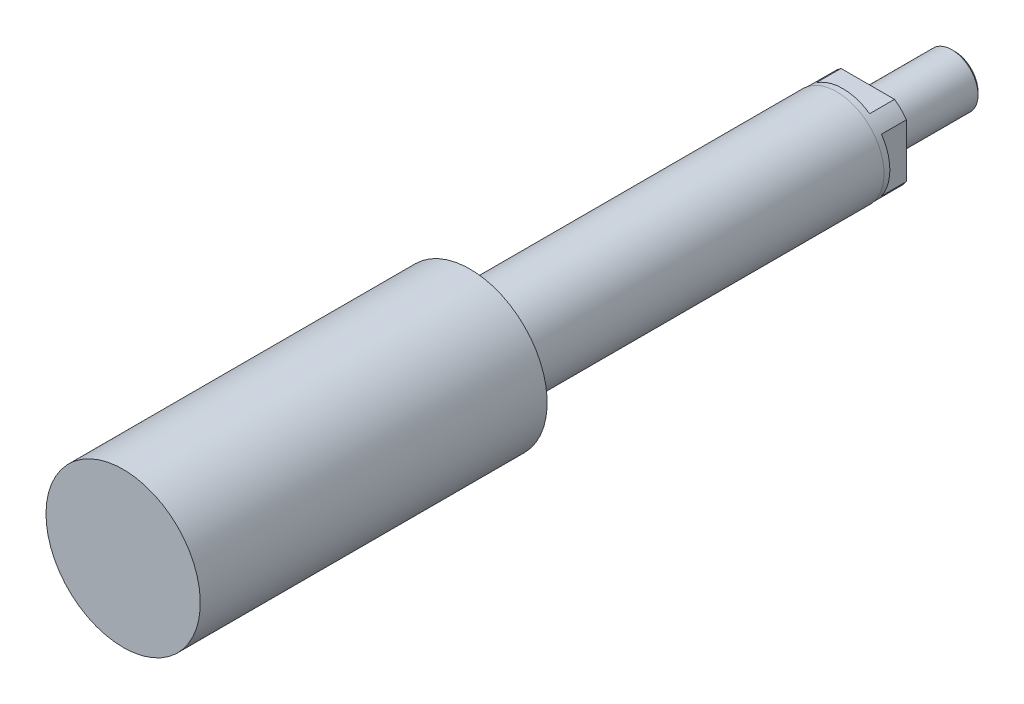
ISO-10303-21;
HEADER;
FILE_DESCRIPTION(('STEP AP214'),'2;1');
FILE_NAME('part.step','',(''),(''),'','','');
FILE_SCHEMA(('AUTOMOTIVE_DESIGN { 1 0 10303 214 1 1 1 1 }'));
ENDSEC;
DATA;
#1=APPLICATION_CONTEXT('core data for automotive mechanical design processes');
#2=APPLICATION_PROTOCOL_DEFINITION('international standard','automotive_design',2000,#1);
#3=PRODUCT_CONTEXT('',#1,'mechanical');
#4=PRODUCT('Part','Part','',(#3));
#5=PRODUCT_RELATED_PRODUCT_CATEGORY('part','',(#4));
#6=PRODUCT_DEFINITION_FORMATION('','',#4);
#7=PRODUCT_DEFINITION_CONTEXT('part definition',#1,'design');
#8=PRODUCT_DEFINITION('design','',#6,#7);
#9=PRODUCT_DEFINITION_SHAPE('','',#8);
#10=(LENGTH_UNIT() NAMED_UNIT(*) SI_UNIT(.MILLI.,.METRE.));
#11=(NAMED_UNIT(*) PLANE_ANGLE_UNIT() SI_UNIT($,.RADIAN.));
#12=(NAMED_UNIT(*) SI_UNIT($,.STERADIAN.) SOLID_ANGLE_UNIT());
#13=UNCERTAINTY_MEASURE_WITH_UNIT(LENGTH_MEASURE(1.E-05),#10,'distance_accuracy_value','');
#14=(GEOMETRIC_REPRESENTATION_CONTEXT(3) GLOBAL_UNCERTAINTY_ASSIGNED_CONTEXT((#13)) GLOBAL_UNIT_ASSIGNED_CONTEXT((#10,
#11,#12)) REPRESENTATION_CONTEXT('',''));
#15=CARTESIAN_POINT('',(0.,0.,0.));
#16=DIRECTION('',(0.,0.,1.));
#17=DIRECTION('',(1.,0.,0.));
#18=AXIS2_PLACEMENT_3D('',#15,#16,#17);
#19=CARTESIAN_POINT('',(-5.29093276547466E-13,-5.42329004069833E-13,-494.40216));
#20=DIRECTION('',(0.,0.,1.));
#21=DIRECTION('',(-1.,0.,0.));
#22=AXIS2_PLACEMENT_3D('',#19,#20,#21);
#23=PLANE('',#22);
#24=CARTESIAN_POINT('',(-5.29093276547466E-13,-5.42329004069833E-13,-494.40216));
#25=DIRECTION('',(0.,0.,1.));
#26=DIRECTION('',(-1.,0.,0.));
#27=AXIS2_PLACEMENT_3D('',#24,#25,#26);
#28=CIRCLE('',#27,18.714);
#29=CARTESIAN_POINT('',(-18.7140000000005,-5.464843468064E-13,-494.40216));
#30=VERTEX_POINT('',#29);
#31=EDGE_CURVE('E172',#30,#30,#28,.F.);
#32=ORIENTED_EDGE('',*,*,#31,.T.);
#33=EDGE_LOOP('',(#32));
#34=FACE_BOUND('',#33,.T.);
#35=ADVANCED_FACE('F16',(#34),#23,.F.);
#36=CARTESIAN_POINT('',(-5.29899732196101E-13,-5.42251488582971E-13,-492.11616));
#37=DIRECTION('',(0.,0.,1.));
#38=DIRECTION('',(-1.,0.,0.));
#39=AXIS2_PLACEMENT_3D('',#36,#37,#38);
#40=CONICAL_SURFACE('',#39,21.,0.785398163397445);
#41=ORIENTED_EDGE('',*,*,#31,.F.);
#42=EDGE_LOOP('',(#41));
#43=FACE_BOUND('',#42,.T.);
#44=CARTESIAN_POINT('',(-5.29899732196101E-13,-5.42251488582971E-13,-492.11616));
#45=DIRECTION('',(0.,0.,1.));
#46=DIRECTION('',(-1.,0.,0.));
#47=AXIS2_PLACEMENT_3D('',#44,#45,#46);
#48=CIRCLE('',#47,21.);
#49=CARTESIAN_POINT('',(-21.0000000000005,-5.46914425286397E-13,-492.11616));
#50=VERTEX_POINT('',#49);
#51=EDGE_CURVE('E175',#50,#50,#48,.T.);
#52=ORIENTED_EDGE('',*,*,#51,.F.);
#53=EDGE_LOOP('',(#52));
#54=FACE_BOUND('',#53,.T.);
#55=ADVANCED_FACE('F194',(#43,#54),#40,.T.);
#56=CARTESIAN_POINT('',(-5.83773227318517E-13,-5.37073237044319E-13,-339.40496));
#57=DIRECTION('',(0.,0.,1.));
#58=DIRECTION('',(-1.,0.,0.));
#59=AXIS2_PLACEMENT_3D('',#56,#57,#58);
#60=CYLINDRICAL_SURFACE('',#59,21.);
#61=ORIENTED_EDGE('',*,*,#51,.T.);
#62=EDGE_LOOP('',(#61));
#63=FACE_BOUND('',#62,.T.);
#64=CARTESIAN_POINT('',(-5.51405216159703E-13,-5.40184408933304E-13,-431.15616));
#65=DIRECTION('',(0.,0.,1.));
#66=DIRECTION('',(-1.,0.,0.));
#67=AXIS2_PLACEMENT_3D('',#64,#65,#66);
#68=CIRCLE('',#67,21.);
#69=CARTESIAN_POINT('',(-21.0000000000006,-5.4484734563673E-13,-431.15616));
#70=VERTEX_POINT('',#69);
#71=EDGE_CURVE('E178',#70,#70,#68,.T.);
#72=ORIENTED_EDGE('',*,*,#71,.F.);
#73=EDGE_LOOP('',(#72));
#74=FACE_BOUND('',#73,.T.);
#75=ADVANCED_FACE('F189',(#63,#74),#60,.T.);
#76=CARTESIAN_POINT('',(-5.53736684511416E-13,-21.0000000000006,-431.15616));
#77=DIRECTION('',(0.,0.,-1.));
#78=DIRECTION('',(1.,0.,0.));
#79=AXIS2_PLACEMENT_3D('',#76,#77,#78);
#80=PLANE('',#79);
#81=CARTESIAN_POINT('',(-5.51405216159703E-13,-5.40184408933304E-13,-431.15616));
#82=DIRECTION('',(0.,0.,1.));
#83=DIRECTION('',(-1.,0.,0.));
#84=AXIS2_PLACEMENT_3D('',#81,#82,#83);
#85=CIRCLE('',#84,18.495999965);
#86=CARTESIAN_POINT('',(-18.4959999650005,-5.44291345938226E-13,-431.15616));
#87=VERTEX_POINT('',#86);
#88=EDGE_CURVE('E122',#87,#87,#85,.T.);
#89=ORIENTED_EDGE('',*,*,#88,.F.);
#90=EDGE_LOOP('',(#89));
#91=FACE_BOUND('',#90,.T.);
#92=ORIENTED_EDGE('',*,*,#71,.T.);
#93=EDGE_LOOP('',(#92));
#94=FACE_BOUND('',#93,.T.);
#95=ADVANCED_FACE('F186',(#91,#94),#80,.F.);
#96=CARTESIAN_POINT('',(-5.83773227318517E-13,-5.37073237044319E-13,-339.40496));
#97=DIRECTION('',(0.,0.,1.));
#98=DIRECTION('',(-1.,0.,0.));
#99=AXIS2_PLACEMENT_3D('',#96,#97,#98);
#100=CYLINDRICAL_SURFACE('',#99,18.495999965);
#101=CARTESIAN_POINT('',(-5.53734976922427E-13,-5.3996047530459E-13,-424.55216));
#102=DIRECTION('',(0.,0.,1.));
#103=DIRECTION('',(-1.,0.,0.));
#104=AXIS2_PLACEMENT_3D('',#101,#102,#103);
#105=CIRCLE('',#104,18.495999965);
#106=CARTESIAN_POINT('',(-18.4959999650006,-5.44067412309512E-13,-424.55216));
#107=VERTEX_POINT('',#106);
#108=EDGE_CURVE('E119',#107,#107,#105,.T.);
#109=ORIENTED_EDGE('',*,*,#108,.F.);
#110=EDGE_LOOP('',(#109));
#111=FACE_BOUND('',#110,.T.);
#112=ORIENTED_EDGE('',*,*,#88,.T.);
#113=EDGE_LOOP('',(#112));
#114=FACE_BOUND('',#113,.T.);
#115=ADVANCED_FACE('F184',(#111,#114),#100,.T.);
#116=CARTESIAN_POINT('',(-5.60790581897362E-13,-5.3928229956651E-13,-404.55216));
#117=DIRECTION('',(0.,0.,-1.));
#118=DIRECTION('',(1.,0.,0.));
#119=AXIS2_PLACEMENT_3D('',#116,#117,#118);
#120=PLANE('',#119);
#121=CARTESIAN_POINT('',(-5.60790581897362E-13,-5.3928229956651E-13,-404.55216));
#122=DIRECTION('',(0.,0.,-1.));
#123=DIRECTION('',(1.,0.,0.));
#124=AXIS2_PLACEMENT_3D('',#121,#122,#123);
#125=CIRCLE('',#124,37.719);
#126=CARTESIAN_POINT('',(-31.0000000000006,-21.4877397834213,-404.55216));
#127=VERTEX_POINT('',#126);
#128=CARTESIAN_POINT('',(-31.0000000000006,21.4877397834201,-404.55216));
#129=VERTEX_POINT('',#128);
#130=EDGE_CURVE('E158',#127,#129,#125,.T.);
#131=ORIENTED_EDGE('',*,*,#130,.T.);
#132=DIRECTION('',(0.,1.,0.));
#133=VECTOR('',#132,1.);
#134=CARTESIAN_POINT('',(-31.0000000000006,-31.0000000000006,-404.55216));
#135=LINE('',#134,#133);
#136=EDGE_CURVE('E33',#127,#129,#135,.T.);
#137=ORIENTED_EDGE('',*,*,#136,.F.);
#138=EDGE_LOOP('',(#131,#137));
#139=FACE_BOUND('',#138,.T.);
#140=ADVANCED_FACE('F240',(#139),#120,.T.);
#141=CARTESIAN_POINT('',(-21.4877397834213,30.9999999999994,-404.55216));
#142=VERTEX_POINT('',#141);
#143=CARTESIAN_POINT('',(21.4877397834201,30.9999999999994,-404.55216));
#144=VERTEX_POINT('',#143);
#145=EDGE_CURVE('E104',#142,#144,#125,.T.);
#146=ORIENTED_EDGE('',*,*,#145,.T.);
#147=DIRECTION('',(1.,0.,0.));
#148=VECTOR('',#147,1.);
#149=CARTESIAN_POINT('',(-31.0000000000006,30.9999999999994,-404.55216));
#150=LINE('',#149,#148);
#151=EDGE_CURVE('E142',#142,#144,#150,.T.);
#152=ORIENTED_EDGE('',*,*,#151,.F.);
#153=EDGE_LOOP('',(#146,#152));
#154=FACE_BOUND('',#153,.T.);
#155=ADVANCED_FACE('F233',(#154),#120,.T.);
#156=CARTESIAN_POINT('',(-31.0000000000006,30.9999999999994,-404.55216));
#157=DIRECTION('',(0.,1.,0.));
#158=DIRECTION('',(0.,0.,-1.));
#159=AXIS2_PLACEMENT_3D('',#156,#157,#158);
#160=PLANE('',#159);
#161=DIRECTION('',(0.,0.,1.));
#162=VECTOR('',#161,1.);
#163=CARTESIAN_POINT('',(-21.4877397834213,30.9999999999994,-339.40496));
#164=LINE('',#163,#162);
#165=CARTESIAN_POINT('',(-21.4877397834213,30.9999999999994,-424.55216));
#166=VERTEX_POINT('',#165);
#167=EDGE_CURVE('E85',#166,#142,#164,.T.);
#168=ORIENTED_EDGE('',*,*,#167,.T.);
#169=ORIENTED_EDGE('',*,*,#151,.T.);
#170=DIRECTION('',(0.,0.,1.));
#171=VECTOR('',#170,1.);
#172=CARTESIAN_POINT('',(21.4877397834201,30.9999999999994,-339.40496));
#173=LINE('',#172,#171);
#174=CARTESIAN_POINT('',(21.4877397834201,30.9999999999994,-424.55216));
#175=VERTEX_POINT('',#174);
#176=EDGE_CURVE('E88',#144,#175,#173,.F.);
#177=ORIENTED_EDGE('',*,*,#176,.T.);
#178=DIRECTION('',(1.,0.,0.));
#179=VECTOR('',#178,1.);
#180=CARTESIAN_POINT('',(-31.0000000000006,30.9999999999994,-424.55216));
#181=LINE('',#180,#179);
#182=EDGE_CURVE('E82',#166,#175,#181,.T.);
#183=ORIENTED_EDGE('',*,*,#182,.F.);
#184=EDGE_LOOP('',(#168,#169,#177,#183));
#185=FACE_BOUND('',#184,.T.);
#186=ADVANCED_FACE('F84',(#185),#160,.T.);
#187=CARTESIAN_POINT('',(30.9999999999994,21.4877397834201,-404.55216));
#188=VERTEX_POINT('',#187);
#189=CARTESIAN_POINT('',(30.9999999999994,-21.4877397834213,-404.55216));
#190=VERTEX_POINT('',#189);
#191=EDGE_CURVE('E169',#188,#190,#125,.T.);
#192=ORIENTED_EDGE('',*,*,#191,.T.);
#193=DIRECTION('',(0.,-1.,0.));
#194=VECTOR('',#193,1.);
#195=CARTESIAN_POINT('',(30.9999999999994,-31.0000000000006,-404.55216));
#196=LINE('',#195,#194);
#197=EDGE_CURVE('E140',#188,#190,#196,.T.);
#198=ORIENTED_EDGE('',*,*,#197,.F.);
#199=EDGE_LOOP('',(#192,#198));
#200=FACE_BOUND('',#199,.T.);
#201=ADVANCED_FACE('F230',(#200),#120,.T.);
#202=CARTESIAN_POINT('',(30.9999999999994,-31.0000000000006,-404.55216));
#203=DIRECTION('',(1.,0.,0.));
#204=DIRECTION('',(0.,1.,0.));
#205=AXIS2_PLACEMENT_3D('',#202,#203,#204);
#206=PLANE('',#205);
#207=DIRECTION('',(0.,0.,1.));
#208=VECTOR('',#207,1.);
#209=CARTESIAN_POINT('',(30.9999999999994,21.4877397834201,-339.40496));
#210=LINE('',#209,#208);
#211=CARTESIAN_POINT('',(30.9999999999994,21.4877397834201,-424.55216));
#212=VERTEX_POINT('',#211);
#213=EDGE_CURVE('E167',#212,#188,#210,.T.);
#214=ORIENTED_EDGE('',*,*,#213,.T.);
#215=ORIENTED_EDGE('',*,*,#197,.T.);
#216=DIRECTION('',(0.,0.,1.));
#217=VECTOR('',#216,1.);
#218=CARTESIAN_POINT('',(30.9999999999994,-21.4877397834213,-339.40496));
#219=LINE('',#218,#217);
#220=CARTESIAN_POINT('',(30.9999999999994,-21.4877397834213,-424.55216));
#221=VERTEX_POINT('',#220);
#222=EDGE_CURVE('E105',#190,#221,#219,.F.);
#223=ORIENTED_EDGE('',*,*,#222,.T.);
#224=DIRECTION('',(0.,-1.,0.));
#225=VECTOR('',#224,1.);
#226=CARTESIAN_POINT('',(30.9999999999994,-31.0000000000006,-424.55216));
#227=LINE('',#226,#225);
#228=EDGE_CURVE('E93',#212,#221,#227,.T.);
#229=ORIENTED_EDGE('',*,*,#228,.F.);
#230=EDGE_LOOP('',(#214,#215,#223,#229));
#231=FACE_BOUND('',#230,.T.);
#232=ADVANCED_FACE('F227',(#231),#206,.T.);
#233=CARTESIAN_POINT('',(21.4877397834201,-31.0000000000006,-404.55216));
#234=VERTEX_POINT('',#233);
#235=CARTESIAN_POINT('',(-21.4877397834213,-31.0000000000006,-404.55216));
#236=VERTEX_POINT('',#235);
#237=EDGE_CURVE('E161',#234,#236,#125,.T.);
#238=ORIENTED_EDGE('',*,*,#237,.T.);
#239=DIRECTION('',(-1.,0.,0.));
#240=VECTOR('',#239,1.);
#241=CARTESIAN_POINT('',(-31.0000000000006,-31.0000000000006,-404.55216));
#242=LINE('',#241,#240);
#243=EDGE_CURVE('E41',#234,#236,#242,.T.);
#244=ORIENTED_EDGE('',*,*,#243,.F.);
#245=EDGE_LOOP('',(#238,#244));
#246=FACE_BOUND('',#245,.T.);
#247=ADVANCED_FACE('F226',(#246),#120,.T.);
#248=CARTESIAN_POINT('',(-31.0000000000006,-31.0000000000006,-404.55216));
#249=DIRECTION('',(0.,-1.,0.));
#250=DIRECTION('',(0.,0.,1.));
#251=AXIS2_PLACEMENT_3D('',#248,#249,#250);
#252=PLANE('',#251);
#253=DIRECTION('',(0.,0.,1.));
#254=VECTOR('',#253,1.);
#255=CARTESIAN_POINT('',(21.4877397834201,-31.0000000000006,-339.40496));
#256=LINE('',#255,#254);
#257=CARTESIAN_POINT('',(21.4877397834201,-31.0000000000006,-424.55216));
#258=VERTEX_POINT('',#257);
#259=EDGE_CURVE('E129',#258,#234,#256,.T.);
#260=ORIENTED_EDGE('',*,*,#259,.T.);
#261=ORIENTED_EDGE('',*,*,#243,.T.);
#262=DIRECTION('',(0.,0.,1.));
#263=VECTOR('',#262,1.);
#264=CARTESIAN_POINT('',(-21.4877397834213,-31.0000000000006,-339.40496));
#265=LINE('',#264,#263);
#266=CARTESIAN_POINT('',(-21.4877397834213,-31.0000000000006,-424.55216));
#267=VERTEX_POINT('',#266);
#268=EDGE_CURVE('E165',#236,#267,#265,.F.);
#269=ORIENTED_EDGE('',*,*,#268,.T.);
#270=DIRECTION('',(-1.,0.,0.));
#271=VECTOR('',#270,1.);
#272=CARTESIAN_POINT('',(-31.0000000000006,-31.0000000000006,-424.55216));
#273=LINE('',#272,#271);
#274=EDGE_CURVE('E132',#258,#267,#273,.T.);
#275=ORIENTED_EDGE('',*,*,#274,.F.);
#276=EDGE_LOOP('',(#260,#261,#269,#275));
#277=FACE_BOUND('',#276,.T.);
#278=ADVANCED_FACE('F223',(#277),#252,.T.);
#279=CARTESIAN_POINT('',(-5.5792262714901E-13,-37.7190000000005,-424.55216));
#280=DIRECTION('',(0.,0.,1.));
#281=DIRECTION('',(-1.,0.,0.));
#282=AXIS2_PLACEMENT_3D('',#279,#280,#281);
#283=PLANE('',#282);
#284=ORIENTED_EDGE('',*,*,#108,.T.);
#285=EDGE_LOOP('',(#284));
#286=FACE_BOUND('',#285,.T.);
#287=DIRECTION('',(0.,1.,0.));
#288=VECTOR('',#287,1.);
#289=CARTESIAN_POINT('',(-31.0000000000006,-31.0000000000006,-424.55216));
#290=LINE('',#289,#288);
#291=CARTESIAN_POINT('',(-31.0000000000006,-21.4877397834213,-424.55216));
#292=VERTEX_POINT('',#291);
#293=CARTESIAN_POINT('',(-31.0000000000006,21.4877397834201,-424.55216));
#294=VERTEX_POINT('',#293);
#295=EDGE_CURVE('E94',#292,#294,#290,.T.);
#296=ORIENTED_EDGE('',*,*,#295,.T.);
#297=CARTESIAN_POINT('',(-5.53734976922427E-13,-5.3996047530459E-13,-424.55216));
#298=DIRECTION('',(0.,0.,1.));
#299=DIRECTION('',(-1.,0.,0.));
#300=AXIS2_PLACEMENT_3D('',#297,#298,#299);
#301=CIRCLE('',#300,37.719);
#302=EDGE_CURVE('E102',#166,#294,#301,.T.);
#303=ORIENTED_EDGE('',*,*,#302,.F.);
#304=ORIENTED_EDGE('',*,*,#182,.T.);
#305=EDGE_CURVE('E110',#212,#175,#301,.T.);
#306=ORIENTED_EDGE('',*,*,#305,.F.);
#307=ORIENTED_EDGE('',*,*,#228,.T.);
#308=EDGE_CURVE('E114',#258,#221,#301,.T.);
#309=ORIENTED_EDGE('',*,*,#308,.F.);
#310=ORIENTED_EDGE('',*,*,#274,.T.);
#311=EDGE_CURVE('E113',#292,#267,#301,.T.);
#312=ORIENTED_EDGE('',*,*,#311,.F.);
#313=EDGE_LOOP('',(#296,#303,#304,#306,#307,#309,#310,#312));
#314=FACE_BOUND('',#313,.T.);
#315=ADVANCED_FACE('F108',(#286,#314),#283,.F.);
#316=CARTESIAN_POINT('',(-31.0000000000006,-31.0000000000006,-404.55216));
#317=DIRECTION('',(-1.,0.,0.));
#318=DIRECTION('',(0.,-1.,0.));
#319=AXIS2_PLACEMENT_3D('',#316,#317,#318);
#320=PLANE('',#319);
#321=DIRECTION('',(0.,0.,1.));
#322=VECTOR('',#321,1.);
#323=CARTESIAN_POINT('',(-31.0000000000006,-21.4877397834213,-339.40496));
#324=LINE('',#323,#322);
#325=EDGE_CURVE('E155',#292,#127,#324,.T.);
#326=ORIENTED_EDGE('',*,*,#325,.T.);
#327=ORIENTED_EDGE('',*,*,#136,.T.);
#328=DIRECTION('',(0.,0.,1.));
#329=VECTOR('',#328,1.);
#330=CARTESIAN_POINT('',(-31.0000000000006,21.4877397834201,-339.40496));
#331=LINE('',#330,#329);
#332=EDGE_CURVE('E159',#129,#294,#331,.F.);
#333=ORIENTED_EDGE('',*,*,#332,.T.);
#334=ORIENTED_EDGE('',*,*,#295,.F.);
#335=EDGE_LOOP('',(#326,#327,#333,#334));
#336=FACE_BOUND('',#335,.T.);
#337=ADVANCED_FACE('F234',(#336),#320,.T.);
#338=CARTESIAN_POINT('',(-5.83773227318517E-13,-5.37073237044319E-13,-339.40496));
#339=DIRECTION('',(0.,0.,1.));
#340=DIRECTION('',(-1.,0.,0.));
#341=AXIS2_PLACEMENT_3D('',#338,#339,#340);
#342=CYLINDRICAL_SURFACE('',#341,37.719);
#343=CARTESIAN_POINT('',(-5.62554483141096E-13,-5.39112755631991E-13,-399.55216));
#344=DIRECTION('',(0.,0.,1.));
#345=DIRECTION('',(-1.,0.,0.));
#346=AXIS2_PLACEMENT_3D('',#343,#344,#345);
#347=CIRCLE('',#346,37.719);
#348=CARTESIAN_POINT('',(-37.7190000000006,-5.47488056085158E-13,-399.55216));
#349=VERTEX_POINT('',#348);
#350=EDGE_CURVE('E111',#349,#349,#347,.T.);
#351=ORIENTED_EDGE('',*,*,#350,.F.);
#352=EDGE_LOOP('',(#351));
#353=FACE_BOUND('',#352,.T.);
#354=ORIENTED_EDGE('',*,*,#325,.F.);
#355=ORIENTED_EDGE('',*,*,#311,.T.);
#356=ORIENTED_EDGE('',*,*,#268,.F.);
#357=ORIENTED_EDGE('',*,*,#237,.F.);
#358=ORIENTED_EDGE('',*,*,#259,.F.);
#359=ORIENTED_EDGE('',*,*,#308,.T.);
#360=ORIENTED_EDGE('',*,*,#222,.F.);
#361=ORIENTED_EDGE('',*,*,#191,.F.);
#362=ORIENTED_EDGE('',*,*,#213,.F.);
#363=ORIENTED_EDGE('',*,*,#305,.T.);
#364=ORIENTED_EDGE('',*,*,#176,.F.);
#365=ORIENTED_EDGE('',*,*,#145,.F.);
#366=ORIENTED_EDGE('',*,*,#167,.F.);
#367=ORIENTED_EDGE('',*,*,#302,.T.);
#368=ORIENTED_EDGE('',*,*,#332,.F.);
#369=ORIENTED_EDGE('',*,*,#130,.F.);
#370=EDGE_LOOP('',(#354,#355,#356,#357,#358,#359,#360,#361,#362,#363,#364,#365,#366,#367,#368,#369));
#371=FACE_BOUND('',#370,.T.);
#372=ADVANCED_FACE('F100',(#353,#371),#342,.T.);
#373=CARTESIAN_POINT('',(0.,0.,-399.55216));
#374=DIRECTION('',(0.,0.,1.));
#375=DIRECTION('',(1.,0.,0.));
#376=AXIS2_PLACEMENT_3D('',#373,#374,#375);
#377=PLANE('',#376);
#378=ORIENTED_EDGE('',*,*,#350,.T.);
#379=EDGE_LOOP('',(#378));
#380=FACE_BOUND('',#379,.T.);
#381=CARTESIAN_POINT('',(0.,0.,-399.55216));
#382=DIRECTION('',(0.,0.,1.));
#383=DIRECTION('',(1.,0.,0.));
#384=AXIS2_PLACEMENT_3D('',#381,#382,#383);
#385=CIRCLE('',#384,38.05174);
#386=CARTESIAN_POINT('',(38.05174,0.,-399.55216));
#387=VERTEX_POINT('',#386);
#388=EDGE_CURVE('E20',#387,#387,#385,.T.);
#389=ORIENTED_EDGE('',*,*,#388,.F.);
#390=EDGE_LOOP('',(#389));
#391=FACE_BOUND('',#390,.T.);
#392=ADVANCED_FACE('F217',(#380,#391),#377,.F.);
#393=CARTESIAN_POINT('',(0.,0.,-183.276681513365));
#394=DIRECTION('',(0.,0.,1.));
#395=DIRECTION('',(1.,0.,0.));
#396=AXIS2_PLACEMENT_3D('',#393,#394,#395);
#397=CYLINDRICAL_SURFACE('',#396,38.05174);
#398=CARTESIAN_POINT('',(0.,0.,-111.3663));
#399=DIRECTION('',(0.,0.,-1.));
#400=DIRECTION('',(0.,1.,0.));
#401=AXIS2_PLACEMENT_3D('',#398,#399,#400);
#402=CIRCLE('',#401,38.05174);
#403=CARTESIAN_POINT('',(0.,38.05174,-111.3663));
#404=VERTEX_POINT('',#403);
#405=EDGE_CURVE('E25',#404,#404,#402,.T.);
#406=ORIENTED_EDGE('',*,*,#405,.T.);
#407=EDGE_LOOP('',(#406));
#408=FACE_BOUND('',#407,.T.);
#409=ORIENTED_EDGE('',*,*,#388,.T.);
#410=EDGE_LOOP('',(#409));
#411=FACE_BOUND('',#410,.T.);
#412=ADVANCED_FACE('F18',(#408,#411),#397,.T.);
#413=CARTESIAN_POINT('',(-6.38309615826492E-13,-5.27646236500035E-13,-111.3663));
#414=DIRECTION('',(0.,0.,-1.));
#415=DIRECTION('',(-0.707106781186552,-0.707106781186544,0.));
#416=AXIS2_PLACEMENT_3D('',#413,#414,#415);
#417=PLANE('',#416);
#418=ORIENTED_EDGE('',*,*,#405,.F.);
#419=EDGE_LOOP('',(#418));
#420=FACE_BOUND('',#419,.T.);
#421=CARTESIAN_POINT('',(-6.38309615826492E-13,-5.27646236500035E-13,-111.3663));
#422=DIRECTION('',(0.,0.,-1.));
#423=DIRECTION('',(-0.707106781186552,-0.707106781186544,0.));
#424=AXIS2_PLACEMENT_3D('',#421,#422,#423);
#425=CIRCLE('',#424,51.6001);
#426=CARTESIAN_POINT('',(-36.4867806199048,-36.4867806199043,-111.3663));
#427=VERTEX_POINT('',#426);
#428=EDGE_CURVE('E150',#427,#427,#425,.T.);
#429=ORIENTED_EDGE('',*,*,#428,.T.);
#430=EDGE_LOOP('',(#429));
#431=FACE_BOUND('',#430,.T.);
#432=ADVANCED_FACE('F205',(#420,#431),#417,.T.);
#433=CARTESIAN_POINT('',(-6.38404926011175E-13,-5.27243042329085E-13,-105.0163));
#434=DIRECTION('',(0.,0.,-1.));
#435=DIRECTION('',(-0.707106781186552,-0.707106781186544,0.));
#436=AXIS2_PLACEMENT_3D('',#433,#434,#435);
#437=CYLINDRICAL_SURFACE('',#436,51.6001);
#438=CARTESIAN_POINT('',(-6.38404926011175E-13,-5.27243042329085E-13,-105.0163));
#439=DIRECTION('',(0.,0.,-1.));
#440=DIRECTION('',(-0.707106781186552,-0.707106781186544,0.));
#441=AXIS2_PLACEMENT_3D('',#438,#439,#440);
#442=CIRCLE('',#441,51.6001);
#443=CARTESIAN_POINT('',(-36.4867806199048,-36.4867806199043,-105.0163));
#444=VERTEX_POINT('',#443);
#445=EDGE_CURVE('E153',#444,#444,#442,.T.);
#446=ORIENTED_EDGE('',*,*,#445,.T.);
#447=EDGE_LOOP('',(#446));
#448=FACE_BOUND('',#447,.T.);
#449=ORIENTED_EDGE('',*,*,#428,.F.);
#450=EDGE_LOOP('',(#449));
#451=FACE_BOUND('',#450,.T.);
#452=ADVANCED_FACE('F207',(#448,#451),#437,.T.);
#453=CARTESIAN_POINT('',(-6.38404926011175E-13,-5.27243042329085E-13,-105.0163));
#454=DIRECTION('',(0.,0.,-1.));
#455=DIRECTION('',(-0.707106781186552,-0.707106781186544,0.));
#456=AXIS2_PLACEMENT_3D('',#453,#454,#455);
#457=PLANE('',#456);
#458=ORIENTED_EDGE('',*,*,#445,.F.);
#459=EDGE_LOOP('',(#458));
#460=FACE_BOUND('',#459,.T.);
#461=CARTESIAN_POINT('',(-6.38404926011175E-13,-5.27243042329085E-13,-105.0163));
#462=DIRECTION('',(0.,0.,-1.));
#463=DIRECTION('',(-0.707106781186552,-0.707106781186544,0.));
#464=AXIS2_PLACEMENT_3D('',#461,#462,#463);
#465=CIRCLE('',#464,61.976);
#466=CARTESIAN_POINT('',(-43.8236498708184,-43.8236498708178,-105.0163));
#467=VERTEX_POINT('',#466);
#468=EDGE_CURVE('E147',#467,#467,#465,.T.);
#469=ORIENTED_EDGE('',*,*,#468,.T.);
#470=EDGE_LOOP('',(#469));
#471=FACE_BOUND('',#470,.T.);
#472=ADVANCED_FACE('F215',(#460,#471),#457,.T.);
#473=CARTESIAN_POINT('',(-6.42893890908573E-13,-5.09243820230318E-13,173.62805));
#474=DIRECTION('',(0.,0.,1.));
#475=DIRECTION('',(0.707106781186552,0.707106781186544,0.));
#476=AXIS2_PLACEMENT_3D('',#473,#474,#475);
#477=PLANE('',#476);
#478=CARTESIAN_POINT('',(-6.42893890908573E-13,-5.09243820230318E-13,173.62805));
#479=DIRECTION('',(0.,0.,1.));
#480=DIRECTION('',(0.707106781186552,0.707106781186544,0.));
#481=AXIS2_PLACEMENT_3D('',#478,#479,#480);
#482=CIRCLE('',#481,61.976);
#483=CARTESIAN_POINT('',(43.8236498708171,43.8236498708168,173.62805));
#484=VERTEX_POINT('',#483);
#485=EDGE_CURVE('E10',#484,#484,#482,.T.);
#486=ORIENTED_EDGE('',*,*,#485,.T.);
#487=EDGE_LOOP('',(#486));
#488=FACE_BOUND('',#487,.T.);
#489=ADVANCED_FACE('F415',(#488),#477,.T.);
#490=CARTESIAN_POINT('',(-6.38964919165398E-13,-5.25864693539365E-13,-88.138));
#491=DIRECTION('',(0.,0.,1.));
#492=DIRECTION('',(0.707106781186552,0.707106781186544,0.));
#493=AXIS2_PLACEMENT_3D('',#490,#491,#492);
#494=CYLINDRICAL_SURFACE('',#493,61.976);
#495=ORIENTED_EDGE('',*,*,#485,.F.);
#496=EDGE_LOOP('',(#495));
#497=FACE_BOUND('',#496,.T.);
#498=ORIENTED_EDGE('',*,*,#468,.F.);
#499=EDGE_LOOP('',(#498));
#500=FACE_BOUND('',#499,.T.);
#501=ADVANCED_FACE('F422',(#497,#500),#494,.T.);
#502=CLOSED_SHELL('',(#35,#55,#75,#95,#115,#140,#155,#186,#201,#232,#247,#278,#315,#337,#372,
#392,#412,#432,#452,#472,#489,#501));
#503=MANIFOLD_SOLID_BREP('B1',#502);
#504=ADVANCED_BREP_SHAPE_REPRESENTATION('',(#18,#503),#14);
#505=SHAPE_DEFINITION_REPRESENTATION(#9,#504);
ENDSEC;
END-ISO-10303-21;
